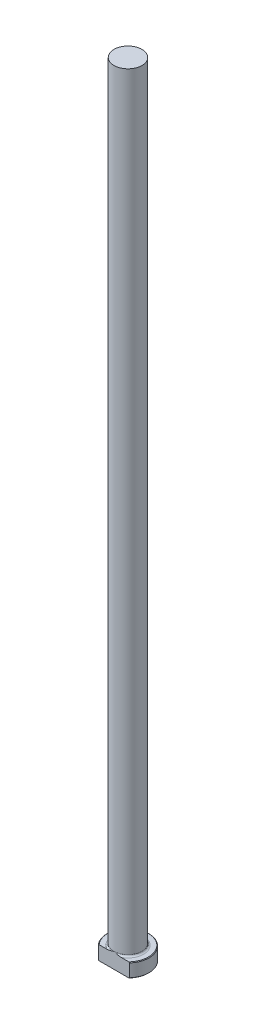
from build123d import *

# Parameters (mm, degrees)
CHAMFER1_SIZE = 0.254
FILLET1_R     = 0.762
KEY_DEPTH     = 356.855042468


with BuildPart() as part:
    # Sketch1 → Revolve1 (revolve)
    with BuildSketch(Plane.XY, mode=Mode.PRIVATE) as revolve1_sk:
        Polygon((0, 0), (-9.525, 0), (-9.525, 6.35), (-6.35, 6.35), (-6.35, 355.6), (0, 355.6), align=None)
    revolve(revolve1_sk.sketch.rotate(Axis((0, 259.958771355, 0), (0, -1, 0)), 270), axis=Axis((0, 259.958771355, 0), (0, -1, 0)))

    # Chamfer1
    chamfer1_edges = [part.edges().sort_by_distance(p)[0] for p in [
        (0, 6.35, -9.525),
        (0, 0, -9.525),
    ]]
    chamfer(chamfer1_edges, length=CHAMFER1_SIZE)

    # Fillet1
    fillet1_edges = [part.edges().sort_by_distance(p)[0] for p in [
        (0, 6.35, -6.35),
    ]]
    fillet(fillet1_edges, radius=FILLET1_R)

    # Sketch2 → Key (cut, through all)
    with BuildSketch(Plane(origin=(0, 0, 0), x_dir=(1, 0, 0), z_dir=(0, 1, 0))):
        with BuildLine():
            Line((-7.099515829, -6.35), (7.099515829, -6.35))
            ThreePointArc((7.099515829, -6.35), (0, -9.525), (-7.099515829, -6.35))
        make_face()
    extrude(amount=KEY_DEPTH, mode=Mode.SUBTRACT)


solid = part.part
